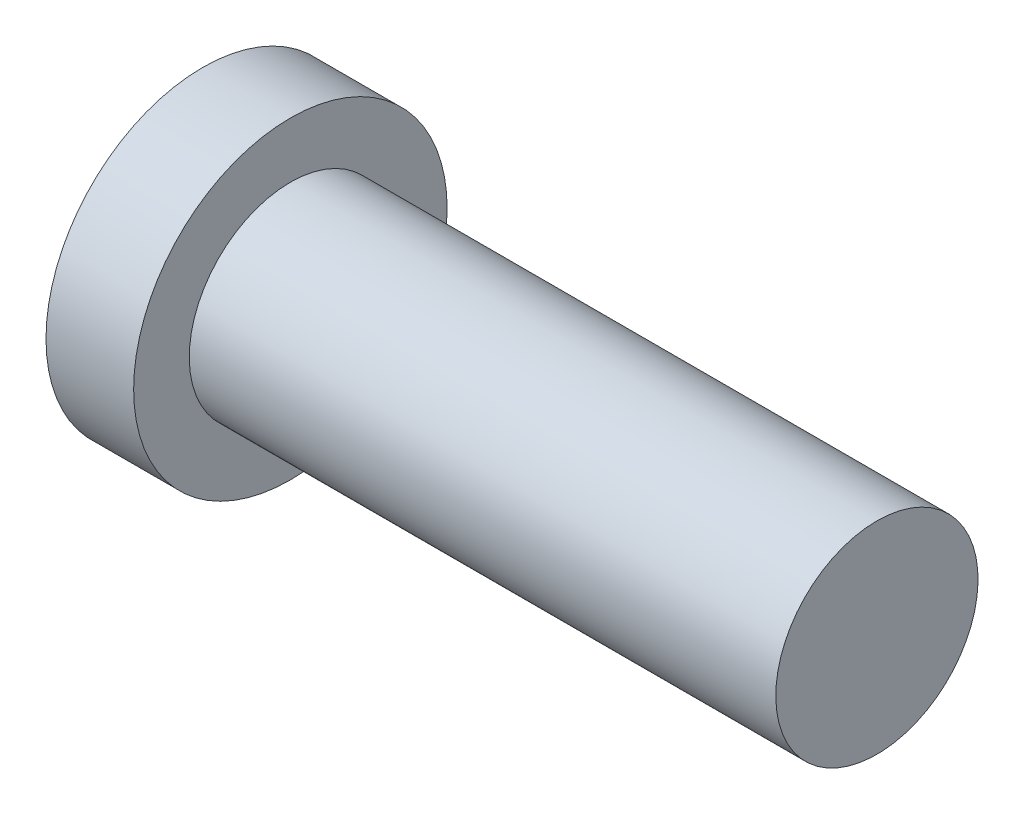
from build123d import *


with BuildPart() as part:
    # Sketch1 → Revolve1 (revolve)
    with BuildSketch(Plane(origin=(-21.063200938, 25.610188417, 0), x_dir=(0, -1, 0), z_dir=(0, 0, 1)), mode=Mode.PRIVATE) as revolve1_sk:
        with BuildLine():
            Line((25.610188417, 21.063200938), (26.000188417, 21.063200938))
            Line((26.000188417, 21.063200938), (26.000188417, 21.354593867))
            ThreePointArc((26.000188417, 21.354593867), (26.068255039, 21.531913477), (26.237488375, 21.618142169))
            Line((26.237488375, 21.618142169), (27.935188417, 21.796577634))
            Line((27.935188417, 21.796577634), (27.935188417, 23.096577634))
            Line((27.935188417, 23.096577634), (27.110188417, 23.096577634))
            Line((27.110188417, 23.096577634), (27.110188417, 31.796577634))
            Line((27.110188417, 31.796577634), (25.610188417, 31.796577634))
            Line((25.610188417, 31.796577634), (25.610188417, 21.063200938))
        make_face()
    revolve(revolve1_sk.sketch.rotate(Axis((28.987368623, 0, 0), (-1, 0, 0)), 180), axis=Axis((28.987368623, 0, 0), (-1, 0, 0)))


solid = part.part
